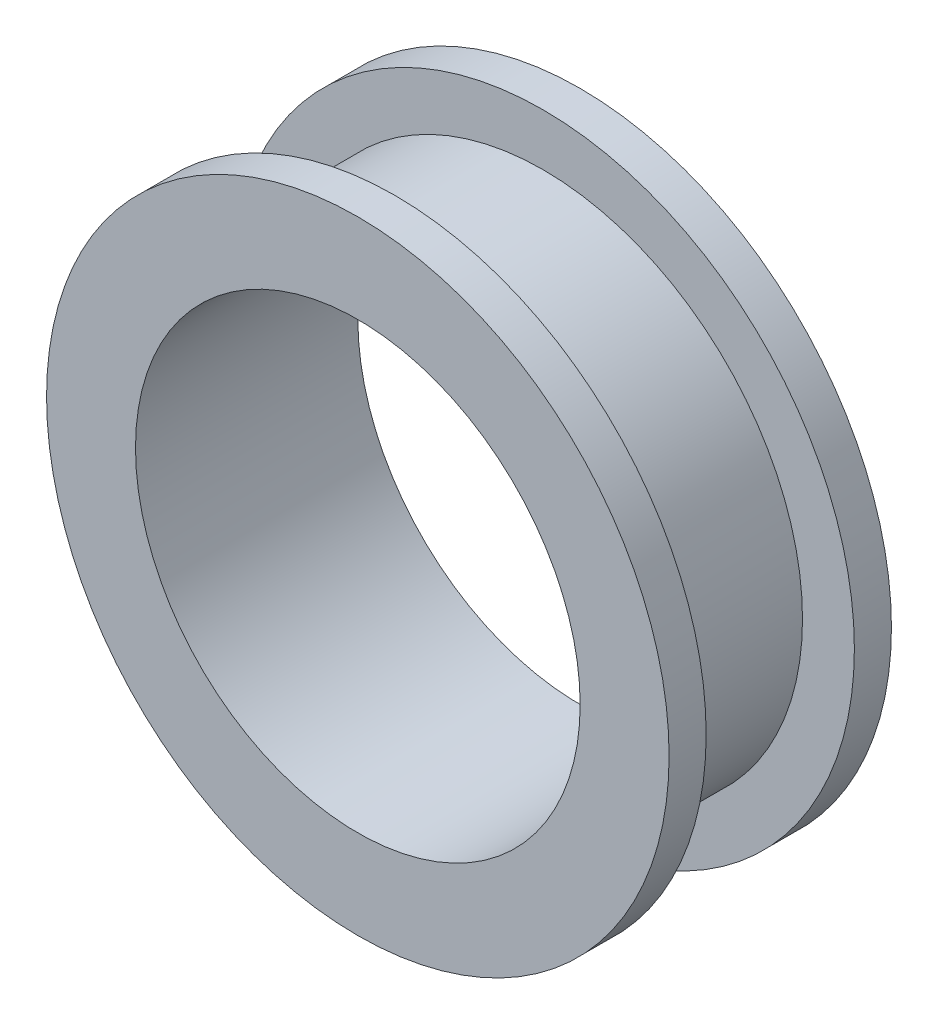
ISO-10303-21;
HEADER;
FILE_DESCRIPTION(('STEP AP214'),'2;1');
FILE_NAME('part.step','',(''),(''),'','','');
FILE_SCHEMA(('AUTOMOTIVE_DESIGN { 1 0 10303 214 1 1 1 1 }'));
ENDSEC;
DATA;
#1=APPLICATION_CONTEXT('core data for automotive mechanical design processes');
#2=APPLICATION_PROTOCOL_DEFINITION('international standard','automotive_design',2000,#1);
#3=PRODUCT_CONTEXT('',#1,'mechanical');
#4=PRODUCT('Part','Part','',(#3));
#5=PRODUCT_RELATED_PRODUCT_CATEGORY('part','',(#4));
#6=PRODUCT_DEFINITION_FORMATION('','',#4);
#7=PRODUCT_DEFINITION_CONTEXT('part definition',#1,'design');
#8=PRODUCT_DEFINITION('design','',#6,#7);
#9=PRODUCT_DEFINITION_SHAPE('','',#8);
#10=(LENGTH_UNIT() NAMED_UNIT(*) SI_UNIT(.MILLI.,.METRE.));
#11=(NAMED_UNIT(*) PLANE_ANGLE_UNIT() SI_UNIT($,.RADIAN.));
#12=(NAMED_UNIT(*) SI_UNIT($,.STERADIAN.) SOLID_ANGLE_UNIT());
#13=UNCERTAINTY_MEASURE_WITH_UNIT(LENGTH_MEASURE(1.E-05),#10,'distance_accuracy_value','');
#14=(GEOMETRIC_REPRESENTATION_CONTEXT(3) GLOBAL_UNCERTAINTY_ASSIGNED_CONTEXT((#13)) GLOBAL_UNIT_ASSIGNED_CONTEXT((#10,
#11,#12)) REPRESENTATION_CONTEXT('',''));
#15=CARTESIAN_POINT('',(0.,0.,0.));
#16=DIRECTION('',(0.,0.,1.));
#17=DIRECTION('',(1.,0.,0.));
#18=AXIS2_PLACEMENT_3D('',#15,#16,#17);
#19=CARTESIAN_POINT('',(0.,42.,10.));
#20=DIRECTION('',(0.,0.,1.));
#21=DIRECTION('',(1.,0.,0.));
#22=AXIS2_PLACEMENT_3D('',#19,#20,#21);
#23=PLANE('',#22);
#24=CARTESIAN_POINT('',(0.,0.,10.));
#25=DIRECTION('',(0.,0.,1.));
#26=DIRECTION('',(1.,0.,0.));
#27=AXIS2_PLACEMENT_3D('',#24,#25,#26);
#28=CIRCLE('',#27,42.);
#29=CARTESIAN_POINT('',(42.,0.,10.));
#30=VERTEX_POINT('',#29);
#31=EDGE_CURVE('E10',#30,#30,#28,.T.);
#32=ORIENTED_EDGE('',*,*,#31,.F.);
#33=EDGE_LOOP('',(#32));
#34=FACE_BOUND('',#33,.T.);
#35=CARTESIAN_POINT('',(0.,0.,10.));
#36=DIRECTION('',(0.,0.,1.));
#37=DIRECTION('',(1.,0.,0.));
#38=AXIS2_PLACEMENT_3D('',#35,#36,#37);
#39=CIRCLE('',#38,35.);
#40=CARTESIAN_POINT('',(35.,0.,10.));
#41=VERTEX_POINT('',#40);
#42=EDGE_CURVE('E59',#41,#41,#39,.T.);
#43=ORIENTED_EDGE('',*,*,#42,.T.);
#44=EDGE_LOOP('',(#43));
#45=FACE_BOUND('',#44,.T.);
#46=ADVANCED_FACE('F31',(#34,#45),#23,.F.);
#47=CARTESIAN_POINT('',(0.,0.,0.));
#48=DIRECTION('',(0.,0.,1.));
#49=DIRECTION('',(1.,0.,0.));
#50=AXIS2_PLACEMENT_3D('',#47,#48,#49);
#51=CYLINDRICAL_SURFACE('',#50,42.);
#52=CARTESIAN_POINT('',(0.,0.,15.));
#53=DIRECTION('',(0.,0.,1.));
#54=DIRECTION('',(1.,0.,0.));
#55=AXIS2_PLACEMENT_3D('',#52,#53,#54);
#56=CIRCLE('',#55,42.);
#57=CARTESIAN_POINT('',(42.,0.,15.));
#58=VERTEX_POINT('',#57);
#59=EDGE_CURVE('E37',#58,#58,#56,.T.);
#60=ORIENTED_EDGE('',*,*,#59,.F.);
#61=EDGE_LOOP('',(#60));
#62=FACE_BOUND('',#61,.T.);
#63=ORIENTED_EDGE('',*,*,#31,.T.);
#64=EDGE_LOOP('',(#63));
#65=FACE_BOUND('',#64,.T.);
#66=ADVANCED_FACE('F96',(#62,#65),#51,.T.);
#67=CARTESIAN_POINT('',(0.,30.,15.));
#68=DIRECTION('',(0.,0.,-1.));
#69=DIRECTION('',(-1.,0.,0.));
#70=AXIS2_PLACEMENT_3D('',#67,#68,#69);
#71=PLANE('',#70);
#72=CARTESIAN_POINT('',(0.,0.,15.));
#73=DIRECTION('',(0.,0.,1.));
#74=DIRECTION('',(1.,0.,0.));
#75=AXIS2_PLACEMENT_3D('',#72,#73,#74);
#76=CIRCLE('',#75,30.);
#77=CARTESIAN_POINT('',(30.,0.,15.));
#78=VERTEX_POINT('',#77);
#79=EDGE_CURVE('E41',#78,#78,#76,.T.);
#80=ORIENTED_EDGE('',*,*,#79,.F.);
#81=EDGE_LOOP('',(#80));
#82=FACE_BOUND('',#81,.T.);
#83=ORIENTED_EDGE('',*,*,#59,.T.);
#84=EDGE_LOOP('',(#83));
#85=FACE_BOUND('',#84,.T.);
#86=ADVANCED_FACE('F91',(#82,#85),#71,.F.);
#87=CARTESIAN_POINT('',(0.,0.,0.));
#88=DIRECTION('',(0.,0.,1.));
#89=DIRECTION('',(1.,0.,0.));
#90=AXIS2_PLACEMENT_3D('',#87,#88,#89);
#91=CYLINDRICAL_SURFACE('',#90,30.);
#92=CARTESIAN_POINT('',(0.,0.,-15.));
#93=DIRECTION('',(0.,0.,1.));
#94=DIRECTION('',(1.,0.,0.));
#95=AXIS2_PLACEMENT_3D('',#92,#93,#94);
#96=CIRCLE('',#95,30.);
#97=CARTESIAN_POINT('',(30.,0.,-15.));
#98=VERTEX_POINT('',#97);
#99=EDGE_CURVE('E45',#98,#98,#96,.T.);
#100=ORIENTED_EDGE('',*,*,#99,.F.);
#101=EDGE_LOOP('',(#100));
#102=FACE_BOUND('',#101,.T.);
#103=ORIENTED_EDGE('',*,*,#79,.T.);
#104=EDGE_LOOP('',(#103));
#105=FACE_BOUND('',#104,.T.);
#106=ADVANCED_FACE('F85',(#102,#105),#91,.F.);
#107=CARTESIAN_POINT('',(0.,42.,-15.));
#108=DIRECTION('',(0.,0.,1.));
#109=DIRECTION('',(1.,0.,0.));
#110=AXIS2_PLACEMENT_3D('',#107,#108,#109);
#111=PLANE('',#110);
#112=CARTESIAN_POINT('',(0.,0.,-15.));
#113=DIRECTION('',(0.,0.,1.));
#114=DIRECTION('',(1.,0.,0.));
#115=AXIS2_PLACEMENT_3D('',#112,#113,#114);
#116=CIRCLE('',#115,42.);
#117=CARTESIAN_POINT('',(42.,0.,-15.));
#118=VERTEX_POINT('',#117);
#119=EDGE_CURVE('E50',#118,#118,#116,.T.);
#120=ORIENTED_EDGE('',*,*,#119,.F.);
#121=EDGE_LOOP('',(#120));
#122=FACE_BOUND('',#121,.T.);
#123=ORIENTED_EDGE('',*,*,#99,.T.);
#124=EDGE_LOOP('',(#123));
#125=FACE_BOUND('',#124,.T.);
#126=ADVANCED_FACE('F79',(#122,#125),#111,.F.);
#127=CARTESIAN_POINT('',(0.,0.,0.));
#128=DIRECTION('',(0.,0.,1.));
#129=DIRECTION('',(1.,0.,0.));
#130=AXIS2_PLACEMENT_3D('',#127,#128,#129);
#131=CYLINDRICAL_SURFACE('',#130,42.);
#132=CARTESIAN_POINT('',(0.,0.,-10.));
#133=DIRECTION('',(0.,0.,1.));
#134=DIRECTION('',(1.,0.,0.));
#135=AXIS2_PLACEMENT_3D('',#132,#133,#134);
#136=CIRCLE('',#135,42.);
#137=CARTESIAN_POINT('',(42.,0.,-10.));
#138=VERTEX_POINT('',#137);
#139=EDGE_CURVE('E53',#138,#138,#136,.T.);
#140=ORIENTED_EDGE('',*,*,#139,.F.);
#141=EDGE_LOOP('',(#140));
#142=FACE_BOUND('',#141,.T.);
#143=ORIENTED_EDGE('',*,*,#119,.T.);
#144=EDGE_LOOP('',(#143));
#145=FACE_BOUND('',#144,.T.);
#146=ADVANCED_FACE('F73',(#142,#145),#131,.T.);
#147=CARTESIAN_POINT('',(0.,35.,-10.));
#148=DIRECTION('',(0.,0.,-1.));
#149=DIRECTION('',(-1.,0.,0.));
#150=AXIS2_PLACEMENT_3D('',#147,#148,#149);
#151=PLANE('',#150);
#152=CARTESIAN_POINT('',(0.,0.,-10.));
#153=DIRECTION('',(0.,0.,1.));
#154=DIRECTION('',(1.,0.,0.));
#155=AXIS2_PLACEMENT_3D('',#152,#153,#154);
#156=CIRCLE('',#155,35.);
#157=CARTESIAN_POINT('',(35.,0.,-10.));
#158=VERTEX_POINT('',#157);
#159=EDGE_CURVE('E56',#158,#158,#156,.T.);
#160=ORIENTED_EDGE('',*,*,#159,.F.);
#161=EDGE_LOOP('',(#160));
#162=FACE_BOUND('',#161,.T.);
#163=ORIENTED_EDGE('',*,*,#139,.T.);
#164=EDGE_LOOP('',(#163));
#165=FACE_BOUND('',#164,.T.);
#166=ADVANCED_FACE('F67',(#162,#165),#151,.F.);
#167=CARTESIAN_POINT('',(0.,0.,0.));
#168=DIRECTION('',(0.,0.,1.));
#169=DIRECTION('',(1.,0.,0.));
#170=AXIS2_PLACEMENT_3D('',#167,#168,#169);
#171=CYLINDRICAL_SURFACE('',#170,35.);
#172=ORIENTED_EDGE('',*,*,#42,.F.);
#173=EDGE_LOOP('',(#172));
#174=FACE_BOUND('',#173,.T.);
#175=ORIENTED_EDGE('',*,*,#159,.T.);
#176=EDGE_LOOP('',(#175));
#177=FACE_BOUND('',#176,.T.);
#178=ADVANCED_FACE('F64',(#174,#177),#171,.T.);
#179=CLOSED_SHELL('',(#46,#66,#86,#106,#126,#146,#166,#178));
#180=MANIFOLD_SOLID_BREP('B2',#179);
#181=ADVANCED_BREP_SHAPE_REPRESENTATION('',(#18,#180),#14);
#182=SHAPE_DEFINITION_REPRESENTATION(#9,#181);
ENDSEC;
END-ISO-10303-21;
